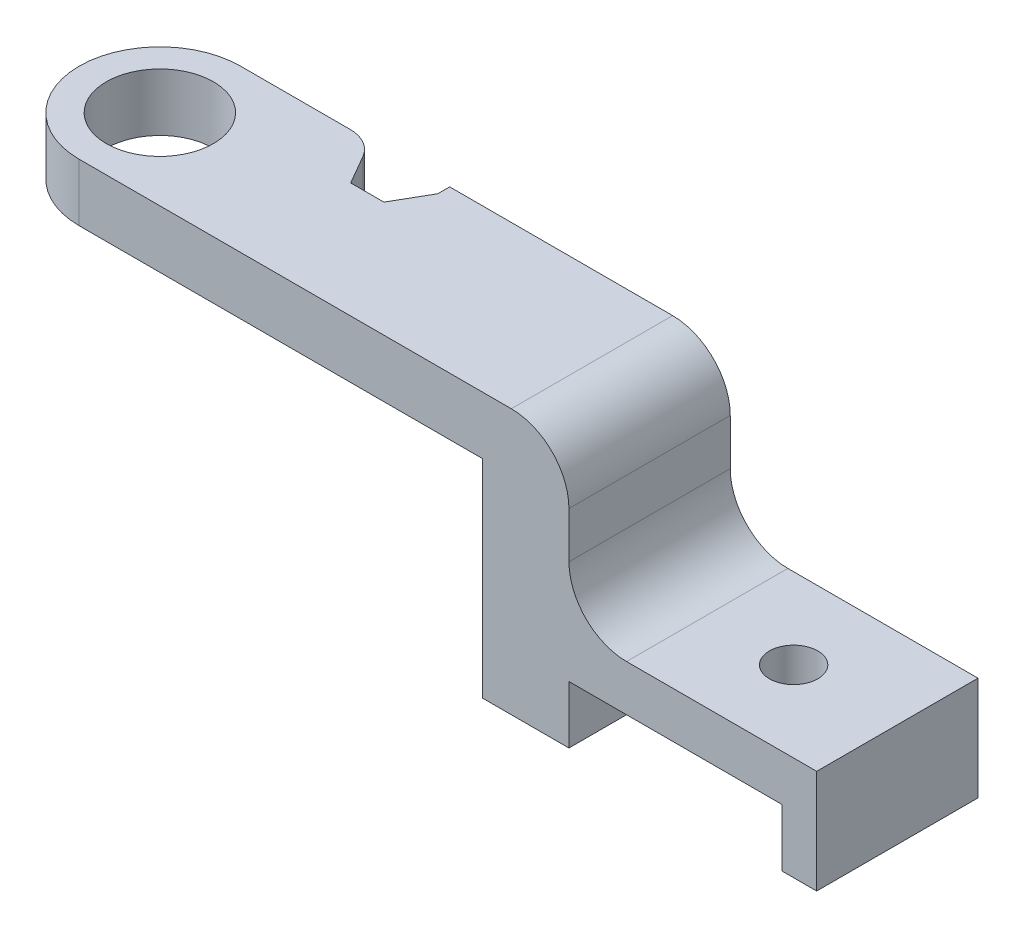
from build123d import *

# Parameters (mm, degrees)
BOSS_EXTRUDE1_DEPTH = 14
SKETCH2_R           = 2.1
CUT_EXTRUDE1_DEPTH  = 8
CUT_EXTRUDE2_DEPTH  = 8
FILLET1_R           = 5
CUT_EXTRUDE3_DEPTH  = 10
FILLET2_R           = 3


with BuildPart() as part:
    # Sketch1 → Boss-Extrude1 (new body)
    with BuildSketch(Plane.XY):
        Polygon((0, 0), (0, 5), (49.5, 5), (49.5, -9), (71, -9), (71, -18), (68, -18), (68, -13), (49.5, -13), (49.5, -18), (42, -18), (42, 0), align=None)
    extrude(amount=BOSS_EXTRUDE1_DEPTH)

    # Sketch2 → Cut-Extrude1 (cut)
    with BuildSketch(Plane(origin=(0, -9, 0), x_dir=(1, 0, 0), z_dir=(0, 1, 0))):
        with Locations(Location((62, -7, 0), (0, 0, 270))):
            Circle(SKETCH2_R)
    extrude(amount=-CUT_EXTRUDE1_DEPTH, mode=Mode.SUBTRACT)

    # Sketch3 → Cut-Extrude2 (cut)
    with BuildSketch(Plane(origin=(0, 5, 0), x_dir=(1, 0, 0), z_dir=(0, 1, 0))):
        with BuildLine():
            Line((0, 0), (0, -7))
            ThreePointArc((0, -7), (2.050252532, -2.050252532), (7, 0))
            Line((7, 0), (0, 0))
        make_face()
        with BuildLine():
            ThreePointArc((7, -14), (2.050252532, -11.949747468), (0, -7))
            Line((0, -7), (0, -14))
            Line((0, -14), (7, -14))
        make_face()
        with BuildLine():
            ThreePointArc((11.65, -7), (7, -2.35), (2.35, -7))
            Line((2.35, -7), (11.65, -7))
        make_face()
        with BuildLine():
            Line((11.65, -7), (2.35, -7))
            ThreePointArc((2.35, -7), (7, -11.65), (11.65, -7))
        make_face()
        with BuildLine():
            ThreePointArc((11.65, -7), (7, -2.35), (2.35, -7))
            Line((2.35, -7), (11.65, -7))
        make_face()
        with BuildLine():
            Line((11.65, -7), (2.35, -7))
            ThreePointArc((2.35, -7), (7, -11.65), (11.65, -7))
        make_face()
    extrude(amount=-CUT_EXTRUDE2_DEPTH, mode=Mode.SUBTRACT)

    # Fillet1
    fillet1_edges = [part.edges().sort_by_distance(p)[0] for p in [
        (49.5, 5, 7),
        (49.5, -9, 7),
    ]]
    fillet(fillet1_edges, radius=FILLET1_R)

    # Sketch4 → Cut-Extrude3 (cut)
    with BuildSketch(Plane(origin=(0, 5, 0), x_dir=(1, 0, 0), z_dir=(0, 1, 0))):
        Polygon((23.441154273, -4), (25.15, -1.040192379), (25.15, 0), (18.85, 0), (18.24944465, 0), (18.85, -1.040192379), (20.558845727, -4), align=None)
    extrude(amount=-CUT_EXTRUDE3_DEPTH, mode=Mode.SUBTRACT)

    # Fillet2
    fillet2_edges = [part.edges().sort_by_distance(p)[0] for p in [
        (18.24944465, 2.5, 0),
    ]]
    fillet(fillet2_edges, radius=FILLET2_R)


solid = part.part
